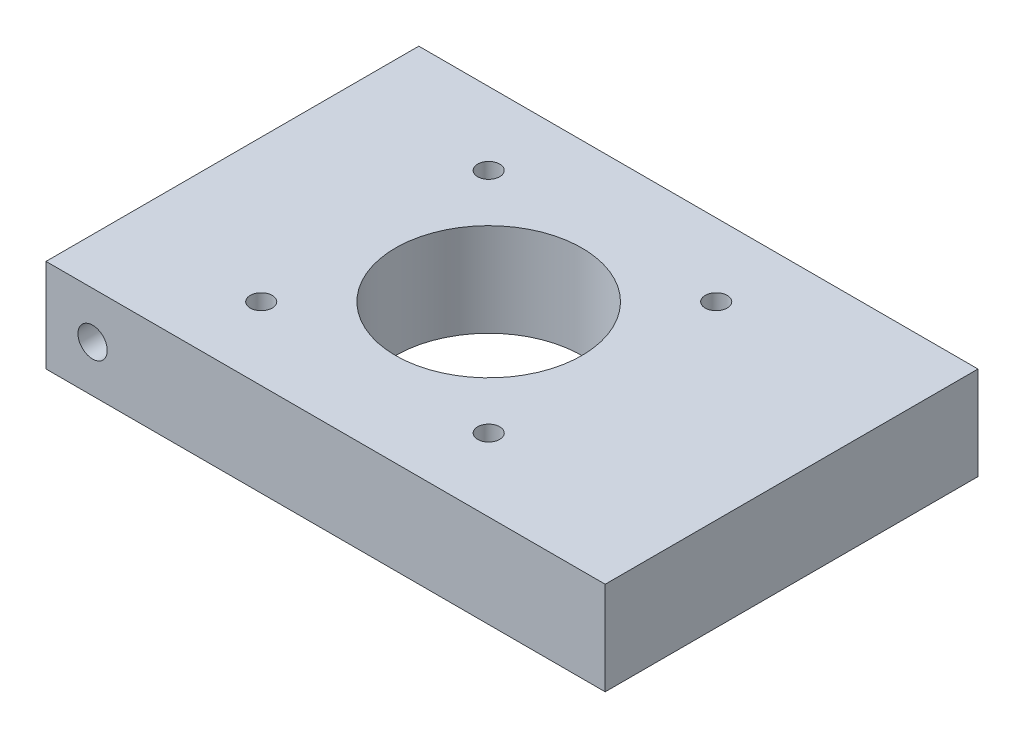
from build123d import *

# Parameters (mm, degrees)
SKETCH1_W           = 76.2
SKETCH1_H           = 50.8
BOSS_EXTRUDE1_DEPTH = 12.7
SKETCH2_R           = 12.7
SKETCH2_R_2         = 1.5
CUT_EXTRUDE1_DEPTH  = 81.935214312
SKETCH3_R           = 2
CUT_EXTRUDE2_DEPTH  = 89.529338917
BOSS_EXTRUDE2_START = -25.4
SKETCH4_R           = 2
BOSS_EXTRUDE2_DEPTH = 25.4


with BuildPart() as part:
    # Sketch1 → Boss-Extrude1 (new body)
    with BuildSketch(Plane(origin=(0, 0, 0), x_dir=(1, 0, 0), z_dir=(0, 1, 0))):
        with Locations((-33.282868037, 10.568111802)):
            Rectangle(SKETCH1_W, SKETCH1_H)
    extrude(amount=BOSS_EXTRUDE1_DEPTH)

    # Sketch2 → Cut-Extrude1 (cut, through all)
    with BuildSketch(Plane(origin=(0, 12.7, 0), x_dir=(1, 0, 0), z_dir=(0, 1, 0))):
        with Locations(Location((-36.457868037, 10.568111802, 0), (0, 0, 270))):
            Circle(SKETCH2_R)
        with Locations(Location((-51.957868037, 26.068111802, 0), (0, 0, 270))):
            Circle(SKETCH2_R_2)
        with Locations(Location((-20.957868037, 26.068111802, 0), (0, 0, 270))):
            Circle(SKETCH2_R_2)
        with Locations(Location((-20.957868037, -4.931888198, 0), (0, 0, 270))):
            Circle(SKETCH2_R_2)
        with Locations(Location((-51.957868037, -4.931888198, 0), (0, 0, 270))):
            Circle(SKETCH2_R_2)
    extrude(amount=-CUT_EXTRUDE1_DEPTH, mode=Mode.SUBTRACT)

    # Sketch3 → Cut-Extrude2 (cut, through all)
    with BuildSketch(Plane(origin=(0, 0, -35.968111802), x_dir=(-1, 0, 0), z_dir=(0, 0, -1))):
        with Locations((65.032868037, 6.35)):
            Circle(SKETCH3_R)
        with Locations((1.532868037, 6.35)):
            Circle(SKETCH3_R)
    extrude(amount=-CUT_EXTRUDE2_DEPTH, mode=Mode.SUBTRACT)

    # Sketch4 → Boss-Extrude2 (add)
    with BuildSketch(Plane.XY.offset(14.831888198).offset(BOSS_EXTRUDE2_START)):
        with Locations(Location((-1.532868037, 6.35, 0), (0, 0, 180))):
            Circle(SKETCH4_R)
    extrude(amount=BOSS_EXTRUDE2_DEPTH)


solid = part.part
